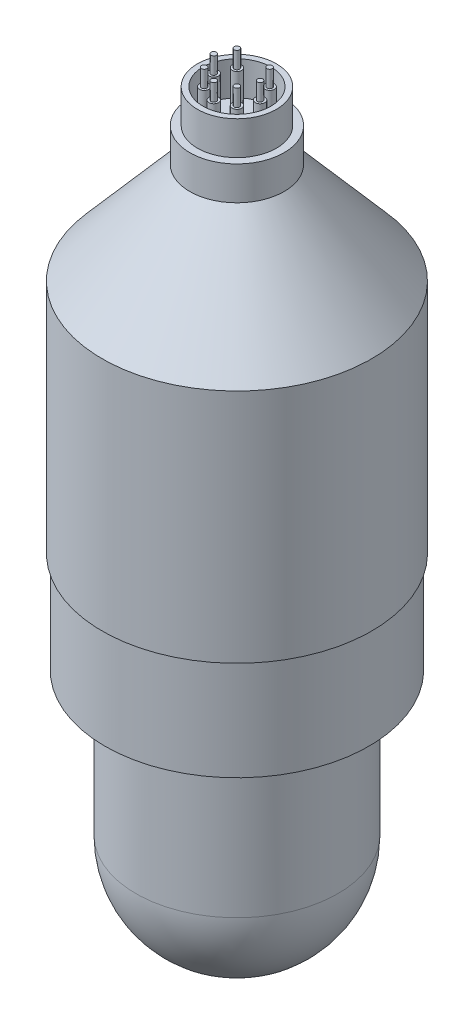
ISO-10303-21;
HEADER;
FILE_DESCRIPTION(('STEP AP214'),'2;1');
FILE_NAME('part.step','',(''),(''),'','','');
FILE_SCHEMA(('AUTOMOTIVE_DESIGN { 1 0 10303 214 1 1 1 1 }'));
ENDSEC;
DATA;
#1=APPLICATION_CONTEXT('core data for automotive mechanical design processes');
#2=APPLICATION_PROTOCOL_DEFINITION('international standard','automotive_design',2000,#1);
#3=PRODUCT_CONTEXT('',#1,'mechanical');
#4=PRODUCT('Part','Part','',(#3));
#5=PRODUCT_RELATED_PRODUCT_CATEGORY('part','',(#4));
#6=PRODUCT_DEFINITION_FORMATION('','',#4);
#7=PRODUCT_DEFINITION_CONTEXT('part definition',#1,'design');
#8=PRODUCT_DEFINITION('design','',#6,#7);
#9=PRODUCT_DEFINITION_SHAPE('','',#8);
#10=(LENGTH_UNIT() NAMED_UNIT(*) SI_UNIT(.MILLI.,.METRE.));
#11=(NAMED_UNIT(*) PLANE_ANGLE_UNIT() SI_UNIT($,.RADIAN.));
#12=(NAMED_UNIT(*) SI_UNIT($,.STERADIAN.) SOLID_ANGLE_UNIT());
#13=UNCERTAINTY_MEASURE_WITH_UNIT(LENGTH_MEASURE(1.E-05),#10,'distance_accuracy_value','');
#14=(GEOMETRIC_REPRESENTATION_CONTEXT(3) GLOBAL_UNCERTAINTY_ASSIGNED_CONTEXT((#13)) GLOBAL_UNIT_ASSIGNED_CONTEXT((#10,
#11,#12)) REPRESENTATION_CONTEXT('',''));
#15=CARTESIAN_POINT('',(0.,0.,0.));
#16=DIRECTION('',(0.,0.,1.));
#17=DIRECTION('',(1.,0.,0.));
#18=AXIS2_PLACEMENT_3D('',#15,#16,#17);
#19=CARTESIAN_POINT('',(0.,0.,0.));
#20=DIRECTION('',(0.,-1.,0.));
#21=DIRECTION('',(0.,0.,-1.));
#22=AXIS2_PLACEMENT_3D('',#19,#20,#21);
#23=CYLINDRICAL_SURFACE('',#22,50.8);
#24=CARTESIAN_POINT('',(0.,-19.304,0.));
#25=DIRECTION('',(0.,-1.,0.));
#26=DIRECTION('',(0.,0.,-1.));
#27=AXIS2_PLACEMENT_3D('',#24,#25,#26);
#28=CIRCLE('',#27,50.8);
#29=CARTESIAN_POINT('',(0.,-19.304,-50.8));
#30=VERTEX_POINT('',#29);
#31=EDGE_CURVE('E102',#30,#30,#28,.T.);
#32=ORIENTED_EDGE('',*,*,#31,.T.);
#33=EDGE_LOOP('',(#32));
#34=FACE_BOUND('',#33,.T.);
#35=CARTESIAN_POINT('',(0.,-108.204,0.));
#36=DIRECTION('',(0.,-1.,0.));
#37=DIRECTION('',(0.,0.,-1.));
#38=AXIS2_PLACEMENT_3D('',#35,#36,#37);
#39=CIRCLE('',#38,50.8);
#40=CARTESIAN_POINT('',(0.,-108.204,-50.8));
#41=VERTEX_POINT('',#40);
#42=EDGE_CURVE('E68',#41,#41,#39,.F.);
#43=ORIENTED_EDGE('',*,*,#42,.T.);
#44=EDGE_LOOP('',(#43));
#45=FACE_BOUND('',#44,.T.);
#46=ADVANCED_FACE('F52',(#34,#45),#23,.T.);
#47=CARTESIAN_POINT('',(14.8868084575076,44.196,0.));
#48=DIRECTION('',(0.,1.,0.));
#49=DIRECTION('',(0.,0.,1.));
#50=AXIS2_PLACEMENT_3D('',#47,#48,#49);
#51=PLANE('',#50);
#52=CARTESIAN_POINT('',(0.,44.196,0.));
#53=DIRECTION('',(0.,-1.,0.));
#54=DIRECTION('',(0.,0.,-1.));
#55=AXIS2_PLACEMENT_3D('',#52,#53,#54);
#56=CIRCLE('',#55,12.827);
#57=CARTESIAN_POINT('',(0.,44.196,-12.827));
#58=VERTEX_POINT('',#57);
#59=EDGE_CURVE('E11',#58,#58,#56,.T.);
#60=ORIENTED_EDGE('',*,*,#59,.T.);
#61=EDGE_LOOP('',(#60));
#62=FACE_BOUND('',#61,.T.);
#63=CARTESIAN_POINT('',(0.,44.196,0.));
#64=DIRECTION('',(0.,-1.,0.));
#65=DIRECTION('',(0.,0.,-1.));
#66=AXIS2_PLACEMENT_3D('',#63,#64,#65);
#67=CIRCLE('',#66,14.8868084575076);
#68=CARTESIAN_POINT('',(0.,44.196,-14.8868084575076));
#69=VERTEX_POINT('',#68);
#70=EDGE_CURVE('E90',#69,#69,#67,.T.);
#71=ORIENTED_EDGE('',*,*,#70,.F.);
#72=EDGE_LOOP('',(#71));
#73=FACE_BOUND('',#72,.T.);
#74=ADVANCED_FACE('F54',(#62,#73),#51,.T.);
#75=CARTESIAN_POINT('',(0.,0.,0.));
#76=DIRECTION('',(0.,-1.,0.));
#77=DIRECTION('',(0.,0.,-1.));
#78=AXIS2_PLACEMENT_3D('',#75,#76,#77);
#79=CYLINDRICAL_SURFACE('',#78,12.827);
#80=CARTESIAN_POINT('',(0.,11.557,0.));
#81=DIRECTION('',(0.,-1.,0.));
#82=DIRECTION('',(0.,0.,-1.));
#83=AXIS2_PLACEMENT_3D('',#80,#81,#82);
#84=CIRCLE('',#83,12.827);
#85=CARTESIAN_POINT('',(0.,11.557,-12.827));
#86=VERTEX_POINT('',#85);
#87=EDGE_CURVE('E60',#86,#86,#84,.T.);
#88=ORIENTED_EDGE('',*,*,#87,.T.);
#89=EDGE_LOOP('',(#88));
#90=FACE_BOUND('',#89,.T.);
#91=ORIENTED_EDGE('',*,*,#59,.F.);
#92=EDGE_LOOP('',(#91));
#93=FACE_BOUND('',#92,.T.);
#94=ADVANCED_FACE('F150',(#90,#93),#79,.F.);
#95=CARTESIAN_POINT('',(12.827,11.557,0.));
#96=DIRECTION('',(0.,1.,0.));
#97=DIRECTION('',(0.,0.,1.));
#98=AXIS2_PLACEMENT_3D('',#95,#96,#97);
#99=PLANE('',#98);
#100=CARTESIAN_POINT('',(0.,11.557,0.));
#101=DIRECTION('',(0.,-1.,0.));
#102=DIRECTION('',(0.,0.,-1.));
#103=AXIS2_PLACEMENT_3D('',#100,#101,#102);
#104=CIRCLE('',#103,9.43913447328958);
#105=CARTESIAN_POINT('',(0.,11.557,-9.43913447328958));
#106=VERTEX_POINT('',#105);
#107=EDGE_CURVE('E65',#106,#106,#104,.T.);
#108=ORIENTED_EDGE('',*,*,#107,.T.);
#109=EDGE_LOOP('',(#108));
#110=FACE_BOUND('',#109,.T.);
#111=ORIENTED_EDGE('',*,*,#87,.F.);
#112=EDGE_LOOP('',(#111));
#113=FACE_BOUND('',#112,.T.);
#114=ADVANCED_FACE('F135',(#110,#113),#99,.T.);
#115=CARTESIAN_POINT('',(0.,0.,0.));
#116=DIRECTION('',(0.,-1.,0.));
#117=DIRECTION('',(0.,0.,-1.));
#118=AXIS2_PLACEMENT_3D('',#115,#116,#117);
#119=CYLINDRICAL_SURFACE('',#118,9.43913447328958);
#120=CARTESIAN_POINT('',(0.,7.747,0.));
#121=DIRECTION('',(0.,-1.,0.));
#122=DIRECTION('',(0.,0.,-1.));
#123=AXIS2_PLACEMENT_3D('',#120,#121,#122);
#124=CIRCLE('',#123,9.43913447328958);
#125=CARTESIAN_POINT('',(0.,7.747,-9.43913447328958));
#126=VERTEX_POINT('',#125);
#127=EDGE_CURVE('E130',#126,#126,#124,.T.);
#128=ORIENTED_EDGE('',*,*,#127,.T.);
#129=EDGE_LOOP('',(#128));
#130=FACE_BOUND('',#129,.T.);
#131=ORIENTED_EDGE('',*,*,#107,.F.);
#132=EDGE_LOOP('',(#131));
#133=FACE_BOUND('',#132,.T.);
#134=ADVANCED_FACE('F138',(#130,#133),#119,.F.);
#135=CARTESIAN_POINT('',(9.43913447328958,7.747,0.));
#136=DIRECTION('',(0.,-1.,0.));
#137=DIRECTION('',(0.,0.,-1.));
#138=AXIS2_PLACEMENT_3D('',#135,#136,#137);
#139=PLANE('',#138);
#140=CARTESIAN_POINT('',(0.,7.747,0.));
#141=DIRECTION('',(0.,-1.,0.));
#142=DIRECTION('',(0.,0.,-1.));
#143=AXIS2_PLACEMENT_3D('',#140,#141,#142);
#144=CIRCLE('',#143,11.1255226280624);
#145=CARTESIAN_POINT('',(0.,7.747,-11.1255226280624));
#146=VERTEX_POINT('',#145);
#147=EDGE_CURVE('E127',#146,#146,#144,.T.);
#148=ORIENTED_EDGE('',*,*,#147,.T.);
#149=EDGE_LOOP('',(#148));
#150=FACE_BOUND('',#149,.T.);
#151=ORIENTED_EDGE('',*,*,#127,.F.);
#152=EDGE_LOOP('',(#151));
#153=FACE_BOUND('',#152,.T.);
#154=ADVANCED_FACE('F140',(#150,#153),#139,.T.);
#155=CARTESIAN_POINT('',(0.,0.,0.));
#156=DIRECTION('',(0.,-1.,0.));
#157=DIRECTION('',(0.,0.,-1.));
#158=AXIS2_PLACEMENT_3D('',#155,#156,#157);
#159=CYLINDRICAL_SURFACE('',#158,11.1255226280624);
#160=CARTESIAN_POINT('',(0.,-0.127,0.));
#161=DIRECTION('',(0.,-1.,0.));
#162=DIRECTION('',(0.,0.,-1.));
#163=AXIS2_PLACEMENT_3D('',#160,#161,#162);
#164=CIRCLE('',#163,11.1255226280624);
#165=CARTESIAN_POINT('',(0.,-0.127,-11.1255226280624));
#166=VERTEX_POINT('',#165);
#167=EDGE_CURVE('E124',#166,#166,#164,.T.);
#168=ORIENTED_EDGE('',*,*,#167,.T.);
#169=EDGE_LOOP('',(#168));
#170=FACE_BOUND('',#169,.T.);
#171=ORIENTED_EDGE('',*,*,#147,.F.);
#172=EDGE_LOOP('',(#171));
#173=FACE_BOUND('',#172,.T.);
#174=ADVANCED_FACE('F147',(#170,#173),#159,.F.);
#175=CARTESIAN_POINT('',(4.9276,-0.127,0.));
#176=DIRECTION('',(0.,1.,0.));
#177=DIRECTION('',(0.,0.,1.));
#178=AXIS2_PLACEMENT_3D('',#175,#176,#177);
#179=PLANE('',#178);
#180=CARTESIAN_POINT('',(0.,-0.127,0.));
#181=DIRECTION('',(0.,-1.,0.));
#182=DIRECTION('',(0.,0.,-1.));
#183=AXIS2_PLACEMENT_3D('',#180,#181,#182);
#184=CIRCLE('',#183,4.9276);
#185=CARTESIAN_POINT('',(0.,-0.127,-4.9276));
#186=VERTEX_POINT('',#185);
#187=EDGE_CURVE('E121',#186,#186,#184,.T.);
#188=ORIENTED_EDGE('',*,*,#187,.T.);
#189=EDGE_LOOP('',(#188));
#190=FACE_BOUND('',#189,.T.);
#191=ORIENTED_EDGE('',*,*,#167,.F.);
#192=EDGE_LOOP('',(#191));
#193=FACE_BOUND('',#192,.T.);
#194=ADVANCED_FACE('F190',(#190,#193),#179,.T.);
#195=CARTESIAN_POINT('',(0.,0.,0.));
#196=DIRECTION('',(0.,-1.,0.));
#197=DIRECTION('',(0.,0.,-1.));
#198=AXIS2_PLACEMENT_3D('',#195,#196,#197);
#199=CYLINDRICAL_SURFACE('',#198,4.9276);
#200=CARTESIAN_POINT('',(0.,-1.143,0.));
#201=DIRECTION('',(0.,-1.,0.));
#202=DIRECTION('',(0.,0.,-1.));
#203=AXIS2_PLACEMENT_3D('',#200,#201,#202);
#204=CIRCLE('',#203,4.9276);
#205=CARTESIAN_POINT('',(0.,-1.143,-4.9276));
#206=VERTEX_POINT('',#205);
#207=EDGE_CURVE('E118',#206,#206,#204,.T.);
#208=ORIENTED_EDGE('',*,*,#207,.T.);
#209=EDGE_LOOP('',(#208));
#210=FACE_BOUND('',#209,.T.);
#211=ORIENTED_EDGE('',*,*,#187,.F.);
#212=EDGE_LOOP('',(#211));
#213=FACE_BOUND('',#212,.T.);
#214=ADVANCED_FACE('F186',(#210,#213),#199,.F.);
#215=CARTESIAN_POINT('',(5.68325,-1.143,0.));
#216=DIRECTION('',(0.,-1.,0.));
#217=DIRECTION('',(0.,0.,-1.));
#218=AXIS2_PLACEMENT_3D('',#215,#216,#217);
#219=PLANE('',#218);
#220=CARTESIAN_POINT('',(0.,-1.143,0.));
#221=DIRECTION('',(0.,-1.,0.));
#222=DIRECTION('',(0.,0.,-1.));
#223=AXIS2_PLACEMENT_3D('',#220,#221,#222);
#224=CIRCLE('',#223,5.68325);
#225=CARTESIAN_POINT('',(0.,-1.143,-5.68325));
#226=VERTEX_POINT('',#225);
#227=EDGE_CURVE('E115',#226,#226,#224,.T.);
#228=ORIENTED_EDGE('',*,*,#227,.T.);
#229=EDGE_LOOP('',(#228));
#230=FACE_BOUND('',#229,.T.);
#231=ORIENTED_EDGE('',*,*,#207,.F.);
#232=EDGE_LOOP('',(#231));
#233=FACE_BOUND('',#232,.T.);
#234=ADVANCED_FACE('F182',(#230,#233),#219,.T.);
#235=CARTESIAN_POINT('',(0.,0.,0.));
#236=DIRECTION('',(0.,-1.,0.));
#237=DIRECTION('',(0.,0.,-1.));
#238=AXIS2_PLACEMENT_3D('',#235,#236,#237);
#239=CYLINDRICAL_SURFACE('',#238,5.68325);
#240=CARTESIAN_POINT('',(0.,-19.177,0.));
#241=DIRECTION('',(0.,-1.,0.));
#242=DIRECTION('',(0.,0.,-1.));
#243=AXIS2_PLACEMENT_3D('',#240,#241,#242);
#244=CIRCLE('',#243,5.68325);
#245=CARTESIAN_POINT('',(0.,-19.177,-5.68325));
#246=VERTEX_POINT('',#245);
#247=EDGE_CURVE('E112',#246,#246,#244,.T.);
#248=ORIENTED_EDGE('',*,*,#247,.T.);
#249=EDGE_LOOP('',(#248));
#250=FACE_BOUND('',#249,.T.);
#251=ORIENTED_EDGE('',*,*,#227,.F.);
#252=EDGE_LOOP('',(#251));
#253=FACE_BOUND('',#252,.T.);
#254=ADVANCED_FACE('F178',(#250,#253),#239,.F.);
#255=CARTESIAN_POINT('',(0.,-19.177,0.));
#256=DIRECTION('',(0.,1.,0.));
#257=DIRECTION('',(0.,0.,1.));
#258=AXIS2_PLACEMENT_3D('',#255,#256,#257);
#259=PLANE('',#258);
#260=ORIENTED_EDGE('',*,*,#247,.F.);
#261=EDGE_LOOP('',(#260));
#262=FACE_BOUND('',#261,.T.);
#263=ADVANCED_FACE('F175',(#262),#259,.T.);
#264=CARTESIAN_POINT('',(0.,-19.304,0.));
#265=DIRECTION('',(0.,-1.,0.));
#266=DIRECTION('',(0.,0.,-1.));
#267=AXIS2_PLACEMENT_3D('',#264,#265,#266);
#268=CONICAL_SURFACE('',#267,50.8,0.714090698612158);
#269=CARTESIAN_POINT('',(0.,18.796,0.));
#270=DIRECTION('',(0.,-1.,0.));
#271=DIRECTION('',(0.,0.,-1.));
#272=AXIS2_PLACEMENT_3D('',#269,#270,#271);
#273=CIRCLE('',#272,17.78);
#274=CARTESIAN_POINT('',(0.,18.796,-17.78));
#275=VERTEX_POINT('',#274);
#276=EDGE_CURVE('E99',#275,#275,#273,.T.);
#277=ORIENTED_EDGE('',*,*,#276,.T.);
#278=EDGE_LOOP('',(#277));
#279=FACE_BOUND('',#278,.T.);
#280=ORIENTED_EDGE('',*,*,#31,.F.);
#281=EDGE_LOOP('',(#280));
#282=FACE_BOUND('',#281,.T.);
#283=ADVANCED_FACE('F160',(#279,#282),#268,.T.);
#284=CARTESIAN_POINT('',(0.,0.,0.));
#285=DIRECTION('',(0.,-1.,0.));
#286=DIRECTION('',(0.,0.,-1.));
#287=AXIS2_PLACEMENT_3D('',#284,#285,#286);
#288=CYLINDRICAL_SURFACE('',#287,17.78);
#289=CARTESIAN_POINT('',(0.,31.496,0.));
#290=DIRECTION('',(0.,-1.,0.));
#291=DIRECTION('',(0.,0.,-1.));
#292=AXIS2_PLACEMENT_3D('',#289,#290,#291);
#293=CIRCLE('',#292,17.78);
#294=CARTESIAN_POINT('',(0.,31.496,-17.78));
#295=VERTEX_POINT('',#294);
#296=EDGE_CURVE('E96',#295,#295,#293,.T.);
#297=ORIENTED_EDGE('',*,*,#296,.T.);
#298=EDGE_LOOP('',(#297));
#299=FACE_BOUND('',#298,.T.);
#300=ORIENTED_EDGE('',*,*,#276,.F.);
#301=EDGE_LOOP('',(#300));
#302=FACE_BOUND('',#301,.T.);
#303=ADVANCED_FACE('F234',(#299,#302),#288,.T.);
#304=CARTESIAN_POINT('',(14.8868084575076,31.496,0.));
#305=DIRECTION('',(0.,1.,0.));
#306=DIRECTION('',(0.,0.,1.));
#307=AXIS2_PLACEMENT_3D('',#304,#305,#306);
#308=PLANE('',#307);
#309=CARTESIAN_POINT('',(0.,31.496,0.));
#310=DIRECTION('',(0.,-1.,0.));
#311=DIRECTION('',(0.,0.,-1.));
#312=AXIS2_PLACEMENT_3D('',#309,#310,#311);
#313=CIRCLE('',#312,14.8868084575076);
#314=CARTESIAN_POINT('',(0.,31.496,-14.8868084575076));
#315=VERTEX_POINT('',#314);
#316=EDGE_CURVE('E93',#315,#315,#313,.T.);
#317=ORIENTED_EDGE('',*,*,#316,.T.);
#318=EDGE_LOOP('',(#317));
#319=FACE_BOUND('',#318,.T.);
#320=ORIENTED_EDGE('',*,*,#296,.F.);
#321=EDGE_LOOP('',(#320));
#322=FACE_BOUND('',#321,.T.);
#323=ADVANCED_FACE('F242',(#319,#322),#308,.T.);
#324=CARTESIAN_POINT('',(0.,0.,0.));
#325=DIRECTION('',(0.,-1.,0.));
#326=DIRECTION('',(0.,0.,-1.));
#327=AXIS2_PLACEMENT_3D('',#324,#325,#326);
#328=CYLINDRICAL_SURFACE('',#327,14.8868084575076);
#329=ORIENTED_EDGE('',*,*,#70,.T.);
#330=EDGE_LOOP('',(#329));
#331=FACE_BOUND('',#330,.T.);
#332=ORIENTED_EDGE('',*,*,#316,.F.);
#333=EDGE_LOOP('',(#332));
#334=FACE_BOUND('',#333,.T.);
#335=ADVANCED_FACE('F249',(#331,#334),#328,.T.);
#336=CARTESIAN_POINT('',(0.,0.,0.));
#337=DIRECTION('',(0.,1.,0.));
#338=DIRECTION('',(0.,0.,1.));
#339=AXIS2_PLACEMENT_3D('',#336,#337,#338);
#340=CYLINDRICAL_SURFACE('',#339,49.784);
#341=CARTESIAN_POINT('',(0.,-146.304,0.));
#342=DIRECTION('',(0.,-1.,0.));
#343=DIRECTION('',(0.,0.,-1.));
#344=AXIS2_PLACEMENT_3D('',#341,#342,#343);
#345=CIRCLE('',#344,49.784);
#346=CARTESIAN_POINT('',(0.,-146.304,-49.784));
#347=VERTEX_POINT('',#346);
#348=EDGE_CURVE('E56',#347,#347,#345,.T.);
#349=ORIENTED_EDGE('',*,*,#348,.F.);
#350=EDGE_LOOP('',(#349));
#351=FACE_BOUND('',#350,.T.);
#352=CARTESIAN_POINT('',(0.,-108.204,0.));
#353=DIRECTION('',(0.,1.,0.));
#354=DIRECTION('',(0.,0.,1.));
#355=AXIS2_PLACEMENT_3D('',#352,#353,#354);
#356=CIRCLE('',#355,49.784);
#357=CARTESIAN_POINT('',(0.,-108.204,49.784));
#358=VERTEX_POINT('',#357);
#359=EDGE_CURVE('E71',#358,#358,#356,.T.);
#360=ORIENTED_EDGE('',*,*,#359,.F.);
#361=EDGE_LOOP('',(#360));
#362=FACE_BOUND('',#361,.T.);
#363=ADVANCED_FACE('F257',(#351,#362),#340,.T.);
#364=CARTESIAN_POINT('',(49.784,-108.204,0.));
#365=DIRECTION('',(0.,-1.,0.));
#366=DIRECTION('',(0.,0.,-1.));
#367=AXIS2_PLACEMENT_3D('',#364,#365,#366);
#368=PLANE('',#367);
#369=ORIENTED_EDGE('',*,*,#42,.F.);
#370=EDGE_LOOP('',(#369));
#371=FACE_BOUND('',#370,.T.);
#372=ORIENTED_EDGE('',*,*,#359,.T.);
#373=EDGE_LOOP('',(#372));
#374=FACE_BOUND('',#373,.T.);
#375=ADVANCED_FACE('F173',(#371,#374),#368,.T.);
#376=CARTESIAN_POINT('',(0.,-200.279,0.));
#377=DIRECTION('',(0.,-1.,0.));
#378=DIRECTION('',(-1.,0.,0.));
#379=AXIS2_PLACEMENT_3D('',#376,#377,#378);
#380=SPHERICAL_SURFACE('',#379,38.1);
#381=CARTESIAN_POINT('',(0.,-200.279,0.));
#382=DIRECTION('',(0.,-1.,0.));
#383=DIRECTION('',(0.,0.,-1.));
#384=AXIS2_PLACEMENT_3D('',#381,#382,#383);
#385=CIRCLE('',#384,38.1);
#386=CARTESIAN_POINT('',(0.,-200.279,-38.1));
#387=VERTEX_POINT('',#386);
#388=EDGE_CURVE('E109',#387,#387,#385,.T.);
#389=ORIENTED_EDGE('',*,*,#388,.T.);
#390=EDGE_LOOP('',(#389));
#391=FACE_BOUND('',#390,.T.);
#392=ADVANCED_FACE('F169',(#391),#380,.T.);
#393=CARTESIAN_POINT('',(0.,0.,0.));
#394=DIRECTION('',(0.,-1.,0.));
#395=DIRECTION('',(0.,0.,-1.));
#396=AXIS2_PLACEMENT_3D('',#393,#394,#395);
#397=CYLINDRICAL_SURFACE('',#396,38.1);
#398=CARTESIAN_POINT('',(0.,-146.304,0.));
#399=DIRECTION('',(0.,-1.,0.));
#400=DIRECTION('',(0.,0.,-1.));
#401=AXIS2_PLACEMENT_3D('',#398,#399,#400);
#402=CIRCLE('',#401,38.1);
#403=CARTESIAN_POINT('',(0.,-146.304,-38.1));
#404=VERTEX_POINT('',#403);
#405=EDGE_CURVE('E105',#404,#404,#402,.T.);
#406=ORIENTED_EDGE('',*,*,#405,.T.);
#407=EDGE_LOOP('',(#406));
#408=FACE_BOUND('',#407,.T.);
#409=ORIENTED_EDGE('',*,*,#388,.F.);
#410=EDGE_LOOP('',(#409));
#411=FACE_BOUND('',#410,.T.);
#412=ADVANCED_FACE('F165',(#408,#411),#397,.T.);
#413=CARTESIAN_POINT('',(50.8,-146.304,0.));
#414=DIRECTION('',(0.,-1.,0.));
#415=DIRECTION('',(0.,0.,-1.));
#416=AXIS2_PLACEMENT_3D('',#413,#414,#415);
#417=PLANE('',#416);
#418=ORIENTED_EDGE('',*,*,#405,.F.);
#419=EDGE_LOOP('',(#418));
#420=FACE_BOUND('',#419,.T.);
#421=ORIENTED_EDGE('',*,*,#348,.T.);
#422=EDGE_LOOP('',(#421));
#423=FACE_BOUND('',#422,.T.);
#424=ADVANCED_FACE('F162',(#420,#423),#417,.T.);
#425=CLOSED_SHELL('',(#46,#74,#94,#114,#134,#154,#174,#194,#214,#234,#254,#263,#283,#303,#323,
#335,#363,#375,#392,#412,#424));
#426=CARTESIAN_POINT('',(0.,-214.5665,0.));
#427=DIRECTION('',(0.,1.,0.));
#428=DIRECTION('',(0.,0.,1.));
#429=AXIS2_PLACEMENT_3D('',#426,#427,#428);
#430=PLANE('',#429);
#431=CARTESIAN_POINT('',(0.,-214.5665,0.));
#432=DIRECTION('',(0.,1.,0.));
#433=DIRECTION('',(0.,0.,1.));
#434=AXIS2_PLACEMENT_3D('',#431,#432,#433);
#435=CIRCLE('',#434,20.6375);
#436=CARTESIAN_POINT('',(0.,-214.5665,20.6375));
#437=VERTEX_POINT('',#436);
#438=EDGE_CURVE('E87',#437,#437,#435,.T.);
#439=ORIENTED_EDGE('',*,*,#438,.T.);
#440=EDGE_LOOP('',(#439));
#441=FACE_BOUND('',#440,.T.);
#442=ADVANCED_FACE('F284',(#441),#430,.T.);
#443=CARTESIAN_POINT('',(0.,0.,0.));
#444=DIRECTION('',(0.,1.,0.));
#445=DIRECTION('',(0.,0.,1.));
#446=AXIS2_PLACEMENT_3D('',#443,#444,#445);
#447=CYLINDRICAL_SURFACE('',#446,20.6375);
#448=CARTESIAN_POINT('',(0.,-187.579,0.));
#449=DIRECTION('',(0.,1.,0.));
#450=DIRECTION('',(0.,0.,1.));
#451=AXIS2_PLACEMENT_3D('',#448,#449,#450);
#452=CIRCLE('',#451,20.6375);
#453=CARTESIAN_POINT('',(0.,-187.579,20.6375));
#454=VERTEX_POINT('',#453);
#455=EDGE_CURVE('E78',#454,#454,#452,.T.);
#456=ORIENTED_EDGE('',*,*,#455,.T.);
#457=EDGE_LOOP('',(#456));
#458=FACE_BOUND('',#457,.T.);
#459=ORIENTED_EDGE('',*,*,#438,.F.);
#460=EDGE_LOOP('',(#459));
#461=FACE_BOUND('',#460,.T.);
#462=ADVANCED_FACE('F287',(#458,#461),#447,.F.);
#463=CARTESIAN_POINT('',(0.,-187.579,0.));
#464=DIRECTION('',(0.,-1.,0.));
#465=DIRECTION('',(0.,0.,-1.));
#466=AXIS2_PLACEMENT_3D('',#463,#464,#465);
#467=PLANE('',#466);
#468=ORIENTED_EDGE('',*,*,#455,.F.);
#469=EDGE_LOOP('',(#468));
#470=FACE_BOUND('',#469,.T.);
#471=ADVANCED_FACE('F296',(#470),#467,.T.);
#472=CLOSED_SHELL('',(#442,#462,#471));
#473=ORIENTED_CLOSED_SHELL('',*,#472,.T.);
#474=BREP_WITH_VOIDS('B2',#425,(#473));
#475=CARTESIAN_POINT('',(5.49926131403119,0.,9.52500000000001));
#476=DIRECTION('',(0.,-1.,0.));
#477=DIRECTION('',(0.,0.,-1.));
#478=AXIS2_PLACEMENT_3D('',#475,#476,#477);
#479=PLANE('',#478);
#480=CARTESIAN_POINT('',(0.,0.,0.));
#481=DIRECTION('',(0.,-1.,0.));
#482=DIRECTION('',(0.,0.,-1.));
#483=AXIS2_PLACEMENT_3D('',#480,#481,#482);
#484=CIRCLE('',#483,8.7757);
#485=CARTESIAN_POINT('',(0.,0.,-8.7757));
#486=VERTEX_POINT('',#485);
#487=EDGE_CURVE('E642',#486,#486,#484,.T.);
#488=ORIENTED_EDGE('',*,*,#487,.F.);
#489=EDGE_LOOP('',(#488));
#490=FACE_BOUND('',#489,.T.);
#491=DIRECTION('',(0.5,0.,-0.866025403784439));
#492=VECTOR('',#491,1.);
#493=CARTESIAN_POINT('',(5.49926131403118,0.,9.52500000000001));
#494=LINE('',#493,#492);
#495=CARTESIAN_POINT('',(5.49926131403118,0.,9.52500000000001));
#496=VERTEX_POINT('',#495);
#497=CARTESIAN_POINT('',(10.9985226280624,0.,0.));
#498=VERTEX_POINT('',#497);
#499=EDGE_CURVE('E500',#496,#498,#494,.T.);
#500=ORIENTED_EDGE('',*,*,#499,.F.);
#501=DIRECTION('',(1.,0.,0.));
#502=VECTOR('',#501,1.);
#503=CARTESIAN_POINT('',(-5.49926131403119,0.,9.52500000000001));
#504=LINE('',#503,#502);
#505=CARTESIAN_POINT('',(-5.49926131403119,0.,9.52500000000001));
#506=VERTEX_POINT('',#505);
#507=EDGE_CURVE('E459',#506,#496,#504,.T.);
#508=ORIENTED_EDGE('',*,*,#507,.F.);
#509=DIRECTION('',(0.5,0.,0.866025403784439));
#510=VECTOR('',#509,1.);
#511=CARTESIAN_POINT('',(-10.9985226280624,0.,0.));
#512=LINE('',#511,#510);
#513=CARTESIAN_POINT('',(-10.9985226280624,0.,0.));
#514=VERTEX_POINT('',#513);
#515=EDGE_CURVE('E453',#514,#506,#512,.T.);
#516=ORIENTED_EDGE('',*,*,#515,.F.);
#517=DIRECTION('',(-0.5,0.,0.866025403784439));
#518=VECTOR('',#517,1.);
#519=CARTESIAN_POINT('',(-5.49926131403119,0.,-9.52500000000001));
#520=LINE('',#519,#518);
#521=CARTESIAN_POINT('',(-5.49926131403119,0.,-9.52500000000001));
#522=VERTEX_POINT('',#521);
#523=EDGE_CURVE('E490',#522,#514,#520,.T.);
#524=ORIENTED_EDGE('',*,*,#523,.F.);
#525=DIRECTION('',(-1.,0.,0.));
#526=VECTOR('',#525,1.);
#527=CARTESIAN_POINT('',(5.49926131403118,0.,-9.52500000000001));
#528=LINE('',#527,#526);
#529=CARTESIAN_POINT('',(5.49926131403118,0.,-9.52500000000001));
#530=VERTEX_POINT('',#529);
#531=EDGE_CURVE('E506',#530,#522,#528,.T.);
#532=ORIENTED_EDGE('',*,*,#531,.F.);
#533=DIRECTION('',(-0.5,0.,-0.866025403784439));
#534=VECTOR('',#533,1.);
#535=CARTESIAN_POINT('',(10.9985226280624,0.,0.));
#536=LINE('',#535,#534);
#537=EDGE_CURVE('E503',#498,#530,#536,.T.);
#538=ORIENTED_EDGE('',*,*,#537,.F.);
#539=EDGE_LOOP('',(#500,#508,#516,#524,#532,#538));
#540=FACE_BOUND('',#539,.T.);
#541=ADVANCED_FACE('F413',(#490,#540),#479,.T.);
#542=CARTESIAN_POINT('',(6.1739260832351,44.196,-6.17392608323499));
#543=DIRECTION('',(0.,1.,0.));
#544=DIRECTION('',(0.707106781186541,0.,0.707106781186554));
#545=AXIS2_PLACEMENT_3D('',#542,#543,#544);
#546=PLANE('',#545);
#547=CARTESIAN_POINT('',(6.1739260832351,44.196,-6.17392608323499));
#548=DIRECTION('',(0.,1.,0.));
#549=DIRECTION('',(0.707106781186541,0.,0.707106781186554));
#550=AXIS2_PLACEMENT_3D('',#547,#548,#549);
#551=CIRCLE('',#550,1.7859375);
#552=CARTESIAN_POINT('',(7.43677460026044,44.196,-4.91107756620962));
#553=VERTEX_POINT('',#552);
#554=EDGE_CURVE('E577',#553,#553,#551,.T.);
#555=ORIENTED_EDGE('',*,*,#554,.T.);
#556=EDGE_LOOP('',(#555));
#557=FACE_BOUND('',#556,.T.);
#558=CARTESIAN_POINT('',(6.1739260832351,44.196,-6.17392608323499));
#559=DIRECTION('',(0.,1.,0.));
#560=DIRECTION('',(0.707106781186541,0.,0.707106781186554));
#561=AXIS2_PLACEMENT_3D('',#558,#559,#560);
#562=CIRCLE('',#561,1.01552297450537);
#563=CARTESIAN_POINT('',(6.89200926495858,44.196,-5.4558429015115));
#564=VERTEX_POINT('',#563);
#565=EDGE_CURVE('E616',#564,#564,#562,.T.);
#566=ORIENTED_EDGE('',*,*,#565,.F.);
#567=EDGE_LOOP('',(#566));
#568=FACE_BOUND('',#567,.T.);
#569=ADVANCED_FACE('F649',(#557,#568),#546,.T.);
#570=CARTESIAN_POINT('',(-6.173926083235,44.196,-6.17392608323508));
#571=DIRECTION('',(0.,1.,0.));
#572=DIRECTION('',(0.707106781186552,0.,-0.707106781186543));
#573=AXIS2_PLACEMENT_3D('',#570,#571,#572);
#574=PLANE('',#573);
#575=CARTESIAN_POINT('',(-6.173926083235,44.196,-6.17392608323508));
#576=DIRECTION('',(0.,1.,0.));
#577=DIRECTION('',(0.707106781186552,0.,-0.707106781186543));
#578=AXIS2_PLACEMENT_3D('',#575,#576,#577);
#579=CIRCLE('',#578,1.7859375);
#580=CARTESIAN_POINT('',(-4.91107756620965,44.196,-7.43677460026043));
#581=VERTEX_POINT('',#580);
#582=EDGE_CURVE('E571',#581,#581,#579,.T.);
#583=ORIENTED_EDGE('',*,*,#582,.T.);
#584=EDGE_LOOP('',(#583));
#585=FACE_BOUND('',#584,.T.);
#586=CARTESIAN_POINT('',(-6.173926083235,44.196,-6.17392608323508));
#587=DIRECTION('',(0.,1.,0.));
#588=DIRECTION('',(0.707106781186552,0.,-0.707106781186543));
#589=AXIS2_PLACEMENT_3D('',#586,#587,#588);
#590=CIRCLE('',#589,1.01552297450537);
#591=CARTESIAN_POINT('',(-5.45584290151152,44.196,-6.89200926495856));
#592=VERTEX_POINT('',#591);
#593=EDGE_CURVE('E610',#592,#592,#590,.T.);
#594=ORIENTED_EDGE('',*,*,#593,.F.);
#595=EDGE_LOOP('',(#594));
#596=FACE_BOUND('',#595,.T.);
#597=ADVANCED_FACE('F655',(#585,#596),#574,.T.);
#598=CARTESIAN_POINT('',(-8.73125,44.196,0.));
#599=DIRECTION('',(0.,1.,0.));
#600=DIRECTION('',(0.,0.,-1.));
#601=AXIS2_PLACEMENT_3D('',#598,#599,#600);
#602=PLANE('',#601);
#603=CARTESIAN_POINT('',(-8.73125,44.196,0.));
#604=DIRECTION('',(0.,1.,0.));
#605=DIRECTION('',(0.,0.,-1.));
#606=AXIS2_PLACEMENT_3D('',#603,#604,#605);
#607=CIRCLE('',#606,1.7859375);
#608=CARTESIAN_POINT('',(-8.73124999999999,44.196,-1.78593750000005));
#609=VERTEX_POINT('',#608);
#610=EDGE_CURVE('E565',#609,#609,#607,.T.);
#611=ORIENTED_EDGE('',*,*,#610,.T.);
#612=EDGE_LOOP('',(#611));
#613=FACE_BOUND('',#612,.T.);
#614=CARTESIAN_POINT('',(-8.73125,44.196,0.));
#615=DIRECTION('',(0.,1.,0.));
#616=DIRECTION('',(0.,0.,-1.));
#617=AXIS2_PLACEMENT_3D('',#614,#615,#616);
#618=CIRCLE('',#617,1.01552297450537);
#619=CARTESIAN_POINT('',(-8.73125,44.196,-1.01552297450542));
#620=VERTEX_POINT('',#619);
#621=EDGE_CURVE('E604',#620,#620,#618,.T.);
#622=ORIENTED_EDGE('',*,*,#621,.F.);
#623=EDGE_LOOP('',(#622));
#624=FACE_BOUND('',#623,.T.);
#625=ADVANCED_FACE('F757',(#613,#624),#602,.T.);
#626=CARTESIAN_POINT('',(-6.17392608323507,44.196,6.17392608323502));
#627=DIRECTION('',(0.,1.,0.));
#628=DIRECTION('',(-0.707106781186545,0.,-0.70710678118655));
#629=AXIS2_PLACEMENT_3D('',#626,#627,#628);
#630=PLANE('',#629);
#631=CARTESIAN_POINT('',(-6.17392608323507,44.196,6.17392608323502));
#632=DIRECTION('',(0.,1.,0.));
#633=DIRECTION('',(-0.707106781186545,0.,-0.70710678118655));
#634=AXIS2_PLACEMENT_3D('',#631,#632,#633);
#635=CIRCLE('',#634,1.7859375);
#636=CARTESIAN_POINT('',(-7.43677460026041,44.196,4.91107756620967));
#637=VERTEX_POINT('',#636);
#638=EDGE_CURVE('E559',#637,#637,#635,.T.);
#639=ORIENTED_EDGE('',*,*,#638,.T.);
#640=EDGE_LOOP('',(#639));
#641=FACE_BOUND('',#640,.T.);
#642=CARTESIAN_POINT('',(-6.17392608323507,44.196,6.17392608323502));
#643=DIRECTION('',(0.,1.,0.));
#644=DIRECTION('',(-0.707106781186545,0.,-0.70710678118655));
#645=AXIS2_PLACEMENT_3D('',#642,#643,#644);
#646=CIRCLE('',#645,1.01552297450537);
#647=CARTESIAN_POINT('',(-6.89200926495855,44.196,5.45584290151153));
#648=VERTEX_POINT('',#647);
#649=EDGE_CURVE('E598',#648,#648,#646,.T.);
#650=ORIENTED_EDGE('',*,*,#649,.F.);
#651=EDGE_LOOP('',(#650));
#652=FACE_BOUND('',#651,.T.);
#653=ADVANCED_FACE('F765',(#641,#652),#630,.T.);
#654=CARTESIAN_POINT('',(0.,44.196,8.73125));
#655=DIRECTION('',(0.,1.,0.));
#656=DIRECTION('',(-1.,0.,0.));
#657=AXIS2_PLACEMENT_3D('',#654,#655,#656);
#658=PLANE('',#657);
#659=CARTESIAN_POINT('',(0.,44.196,8.73125));
#660=DIRECTION('',(0.,1.,0.));
#661=DIRECTION('',(-1.,0.,0.));
#662=AXIS2_PLACEMENT_3D('',#659,#660,#661);
#663=CIRCLE('',#662,1.7859375);
#664=CARTESIAN_POINT('',(-1.78593750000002,44.196,8.73125));
#665=VERTEX_POINT('',#664);
#666=EDGE_CURVE('E553',#665,#665,#663,.T.);
#667=ORIENTED_EDGE('',*,*,#666,.T.);
#668=EDGE_LOOP('',(#667));
#669=FACE_BOUND('',#668,.T.);
#670=CARTESIAN_POINT('',(0.,44.196,8.73125));
#671=DIRECTION('',(0.,1.,0.));
#672=DIRECTION('',(-1.,0.,0.));
#673=AXIS2_PLACEMENT_3D('',#670,#671,#672);
#674=CIRCLE('',#673,1.01552297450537);
#675=CARTESIAN_POINT('',(-1.0155229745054,44.196,8.73125));
#676=VERTEX_POINT('',#675);
#677=EDGE_CURVE('E592',#676,#676,#674,.T.);
#678=ORIENTED_EDGE('',*,*,#677,.F.);
#679=EDGE_LOOP('',(#678));
#680=FACE_BOUND('',#679,.T.);
#681=ADVANCED_FACE('F773',(#669,#680),#658,.T.);
#682=CARTESIAN_POINT('',(6.17392608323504,44.196,6.17392608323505));
#683=DIRECTION('',(0.,1.,0.));
#684=DIRECTION('',(-0.707106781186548,0.,0.707106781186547));
#685=AXIS2_PLACEMENT_3D('',#682,#683,#684);
#686=PLANE('',#685);
#687=CARTESIAN_POINT('',(6.17392608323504,44.196,6.17392608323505));
#688=DIRECTION('',(0.,1.,0.));
#689=DIRECTION('',(-0.707106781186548,0.,0.707106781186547));
#690=AXIS2_PLACEMENT_3D('',#687,#688,#689);
#691=CIRCLE('',#690,1.7859375);
#692=CARTESIAN_POINT('',(4.91107756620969,44.196,7.4367746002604));
#693=VERTEX_POINT('',#692);
#694=EDGE_CURVE('E547',#693,#693,#691,.T.);
#695=ORIENTED_EDGE('',*,*,#694,.T.);
#696=EDGE_LOOP('',(#695));
#697=FACE_BOUND('',#696,.T.);
#698=CARTESIAN_POINT('',(6.17392608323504,44.196,6.17392608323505));
#699=DIRECTION('',(0.,1.,0.));
#700=DIRECTION('',(-0.707106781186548,0.,0.707106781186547));
#701=AXIS2_PLACEMENT_3D('',#698,#699,#700);
#702=CIRCLE('',#701,1.01552297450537);
#703=CARTESIAN_POINT('',(5.45584290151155,44.196,6.89200926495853));
#704=VERTEX_POINT('',#703);
#705=EDGE_CURVE('E586',#704,#704,#702,.T.);
#706=ORIENTED_EDGE('',*,*,#705,.F.);
#707=EDGE_LOOP('',(#706));
#708=FACE_BOUND('',#707,.T.);
#709=ADVANCED_FACE('F781',(#697,#708),#686,.T.);
#710=CARTESIAN_POINT('',(0.,31.496,0.));
#711=DIRECTION('',(0.,1.,0.));
#712=DIRECTION('',(0.,0.,1.));
#713=AXIS2_PLACEMENT_3D('',#710,#711,#712);
#714=PLANE('',#713);
#715=CARTESIAN_POINT('',(-6.173926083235,31.496,-6.17392608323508));
#716=DIRECTION('',(0.,1.,0.));
#717=DIRECTION('',(0.707106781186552,0.,-0.707106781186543));
#718=AXIS2_PLACEMENT_3D('',#715,#716,#717);
#719=CIRCLE('',#718,1.7859375);
#720=CARTESIAN_POINT('',(-4.91107756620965,31.496,-7.43677460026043));
#721=VERTEX_POINT('',#720);
#722=EDGE_CURVE('E574',#721,#721,#719,.T.);
#723=ORIENTED_EDGE('',*,*,#722,.F.);
#724=EDGE_LOOP('',(#723));
#725=FACE_BOUND('',#724,.T.);
#726=CARTESIAN_POINT('',(-6.17392608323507,31.496,6.17392608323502));
#727=DIRECTION('',(0.,1.,0.));
#728=DIRECTION('',(-0.707106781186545,0.,-0.70710678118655));
#729=AXIS2_PLACEMENT_3D('',#726,#727,#728);
#730=CIRCLE('',#729,1.7859375);
#731=CARTESIAN_POINT('',(-7.43677460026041,31.496,4.91107756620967));
#732=VERTEX_POINT('',#731);
#733=EDGE_CURVE('E562',#732,#732,#730,.T.);
#734=ORIENTED_EDGE('',*,*,#733,.F.);
#735=EDGE_LOOP('',(#734));
#736=FACE_BOUND('',#735,.T.);
#737=CARTESIAN_POINT('',(6.17392608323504,31.496,6.17392608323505));
#738=DIRECTION('',(0.,1.,0.));
#739=DIRECTION('',(-0.707106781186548,0.,0.707106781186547));
#740=AXIS2_PLACEMENT_3D('',#737,#738,#739);
#741=CIRCLE('',#740,1.7859375);
#742=CARTESIAN_POINT('',(4.91107756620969,31.496,7.4367746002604));
#743=VERTEX_POINT('',#742);
#744=EDGE_CURVE('E550',#743,#743,#741,.T.);
#745=ORIENTED_EDGE('',*,*,#744,.F.);
#746=EDGE_LOOP('',(#745));
#747=FACE_BOUND('',#746,.T.);
#748=CARTESIAN_POINT('',(0.,31.496,0.));
#749=DIRECTION('',(0.,1.,0.));
#750=DIRECTION('',(0.,0.,1.));
#751=AXIS2_PLACEMENT_3D('',#748,#749,#750);
#752=CIRCLE('',#751,12.7);
#753=CARTESIAN_POINT('',(0.,31.496,12.7));
#754=VERTEX_POINT('',#753);
#755=EDGE_CURVE('E531',#754,#754,#752,.T.);
#756=ORIENTED_EDGE('',*,*,#755,.T.);
#757=EDGE_LOOP('',(#756));
#758=FACE_BOUND('',#757,.T.);
#759=CARTESIAN_POINT('',(8.73125,31.496,0.));
#760=DIRECTION('',(0.,1.,0.));
#761=DIRECTION('',(0.,0.,1.));
#762=AXIS2_PLACEMENT_3D('',#759,#760,#761);
#763=CIRCLE('',#762,1.7859375);
#764=CARTESIAN_POINT('',(8.73125,31.496,1.7859375));
#765=VERTEX_POINT('',#764);
#766=EDGE_CURVE('E538',#765,#765,#763,.T.);
#767=ORIENTED_EDGE('',*,*,#766,.F.);
#768=EDGE_LOOP('',(#767));
#769=FACE_BOUND('',#768,.T.);
#770=CARTESIAN_POINT('',(0.,31.496,8.73125));
#771=DIRECTION('',(0.,1.,0.));
#772=DIRECTION('',(-1.,0.,0.));
#773=AXIS2_PLACEMENT_3D('',#770,#771,#772);
#774=CIRCLE('',#773,1.7859375);
#775=CARTESIAN_POINT('',(-1.78593750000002,31.496,8.73125));
#776=VERTEX_POINT('',#775);
#777=EDGE_CURVE('E556',#776,#776,#774,.T.);
#778=ORIENTED_EDGE('',*,*,#777,.F.);
#779=EDGE_LOOP('',(#778));
#780=FACE_BOUND('',#779,.T.);
#781=CARTESIAN_POINT('',(-8.73125,31.496,0.));
#782=DIRECTION('',(0.,1.,0.));
#783=DIRECTION('',(0.,0.,-1.));
#784=AXIS2_PLACEMENT_3D('',#781,#782,#783);
#785=CIRCLE('',#784,1.7859375);
#786=CARTESIAN_POINT('',(-8.73124999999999,31.496,-1.78593750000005));
#787=VERTEX_POINT('',#786);
#788=EDGE_CURVE('E568',#787,#787,#785,.T.);
#789=ORIENTED_EDGE('',*,*,#788,.F.);
#790=EDGE_LOOP('',(#789));
#791=FACE_BOUND('',#790,.T.);
#792=CARTESIAN_POINT('',(6.1739260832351,31.496,-6.17392608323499));
#793=DIRECTION('',(0.,1.,0.));
#794=DIRECTION('',(0.707106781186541,0.,0.707106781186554));
#795=AXIS2_PLACEMENT_3D('',#792,#793,#794);
#796=CIRCLE('',#795,1.7859375);
#797=CARTESIAN_POINT('',(7.43677460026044,31.496,-4.91107756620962));
#798=VERTEX_POINT('',#797);
#799=EDGE_CURVE('E580',#798,#798,#796,.T.);
#800=ORIENTED_EDGE('',*,*,#799,.F.);
#801=EDGE_LOOP('',(#800));
#802=FACE_BOUND('',#801,.T.);
#803=ADVANCED_FACE('F789',(#725,#736,#747,#758,#769,#780,#791,#802),#714,.T.);
#804=CARTESIAN_POINT('',(8.73125,44.196,0.));
#805=DIRECTION('',(0.,1.,0.));
#806=DIRECTION('',(0.,0.,1.));
#807=AXIS2_PLACEMENT_3D('',#804,#805,#806);
#808=PLANE('',#807);
#809=CARTESIAN_POINT('',(8.73125,44.196,0.));
#810=DIRECTION('',(0.,1.,0.));
#811=DIRECTION('',(0.,0.,1.));
#812=AXIS2_PLACEMENT_3D('',#809,#810,#811);
#813=CIRCLE('',#812,1.7859375);
#814=CARTESIAN_POINT('',(8.73125,44.196,1.7859375));
#815=VERTEX_POINT('',#814);
#816=EDGE_CURVE('E535',#815,#815,#813,.T.);
#817=ORIENTED_EDGE('',*,*,#816,.T.);
#818=EDGE_LOOP('',(#817));
#819=FACE_BOUND('',#818,.T.);
#820=CARTESIAN_POINT('',(8.73125,44.196,0.));
#821=DIRECTION('',(0.,1.,0.));
#822=DIRECTION('',(0.,0.,1.));
#823=AXIS2_PLACEMENT_3D('',#820,#821,#822);
#824=CIRCLE('',#823,1.01552297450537);
#825=CARTESIAN_POINT('',(8.73125,44.196,1.01552297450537));
#826=VERTEX_POINT('',#825);
#827=EDGE_CURVE('E544',#826,#826,#824,.T.);
#828=ORIENTED_EDGE('',*,*,#827,.F.);
#829=EDGE_LOOP('',(#828));
#830=FACE_BOUND('',#829,.T.);
#831=ADVANCED_FACE('F803',(#819,#830),#808,.T.);
#832=CARTESIAN_POINT('',(5.49926131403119,7.62,9.52500000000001));
#833=DIRECTION('',(0.,-1.,0.));
#834=DIRECTION('',(0.,0.,-1.));
#835=AXIS2_PLACEMENT_3D('',#832,#833,#834);
#836=PLANE('',#835);
#837=DIRECTION('',(0.5,0.,-0.866025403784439));
#838=VECTOR('',#837,1.);
#839=CARTESIAN_POINT('',(5.49926131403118,7.62,9.52500000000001));
#840=LINE('',#839,#838);
#841=CARTESIAN_POINT('',(5.49926131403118,7.62,9.52500000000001));
#842=VERTEX_POINT('',#841);
#843=CARTESIAN_POINT('',(10.9985226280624,7.62,0.));
#844=VERTEX_POINT('',#843);
#845=EDGE_CURVE('E511',#842,#844,#840,.T.);
#846=ORIENTED_EDGE('',*,*,#845,.T.);
#847=DIRECTION('',(-0.5,0.,-0.866025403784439));
#848=VECTOR('',#847,1.);
#849=CARTESIAN_POINT('',(10.9985226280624,7.62,0.));
#850=LINE('',#849,#848);
#851=CARTESIAN_POINT('',(5.49926131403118,7.62,-9.52500000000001));
#852=VERTEX_POINT('',#851);
#853=EDGE_CURVE('E468',#844,#852,#850,.T.);
#854=ORIENTED_EDGE('',*,*,#853,.T.);
#855=DIRECTION('',(-1.,0.,0.));
#856=VECTOR('',#855,1.);
#857=CARTESIAN_POINT('',(5.49926131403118,7.62,-9.52500000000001));
#858=LINE('',#857,#856);
#859=CARTESIAN_POINT('',(-5.49926131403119,7.62,-9.52500000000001));
#860=VERTEX_POINT('',#859);
#861=EDGE_CURVE('E482',#852,#860,#858,.T.);
#862=ORIENTED_EDGE('',*,*,#861,.T.);
#863=DIRECTION('',(-0.5,0.,0.866025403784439));
#864=VECTOR('',#863,1.);
#865=CARTESIAN_POINT('',(-5.49926131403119,7.62,-9.52500000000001));
#866=LINE('',#865,#864);
#867=CARTESIAN_POINT('',(-10.9985226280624,7.62,0.));
#868=VERTEX_POINT('',#867);
#869=EDGE_CURVE('E475',#860,#868,#866,.T.);
#870=ORIENTED_EDGE('',*,*,#869,.T.);
#871=DIRECTION('',(0.5,0.,0.866025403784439));
#872=VECTOR('',#871,1.);
#873=CARTESIAN_POINT('',(-10.9985226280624,7.62,0.));
#874=LINE('',#873,#872);
#875=CARTESIAN_POINT('',(-5.49926131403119,7.62,9.52500000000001));
#876=VERTEX_POINT('',#875);
#877=EDGE_CURVE('E480',#868,#876,#874,.T.);
#878=ORIENTED_EDGE('',*,*,#877,.T.);
#879=DIRECTION('',(1.,0.,0.));
#880=VECTOR('',#879,1.);
#881=CARTESIAN_POINT('',(-5.49926131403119,7.62,9.52500000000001));
#882=LINE('',#881,#880);
#883=EDGE_CURVE('E430',#876,#842,#882,.T.);
#884=ORIENTED_EDGE('',*,*,#883,.T.);
#885=EDGE_LOOP('',(#846,#854,#862,#870,#878,#884));
#886=FACE_BOUND('',#885,.T.);
#887=CARTESIAN_POINT('',(0.,7.62,0.));
#888=DIRECTION('',(0.,-1.,0.));
#889=DIRECTION('',(0.,0.,-1.));
#890=AXIS2_PLACEMENT_3D('',#887,#888,#889);
#891=CIRCLE('',#890,9.31213447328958);
#892=CARTESIAN_POINT('',(0.,7.62,-9.31213447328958));
#893=VERTEX_POINT('',#892);
#894=EDGE_CURVE('E49',#893,#893,#891,.F.);
#895=ORIENTED_EDGE('',*,*,#894,.F.);
#896=EDGE_LOOP('',(#895));
#897=FACE_BOUND('',#896,.T.);
#898=ADVANCED_FACE('F477',(#886,#897),#836,.F.);
#899=CARTESIAN_POINT('',(5.49926131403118,7.62,9.52500000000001));
#900=DIRECTION('',(-0.866025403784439,0.,-0.5));
#901=DIRECTION('',(-0.5,0.,0.866025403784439));
#902=AXIS2_PLACEMENT_3D('',#899,#900,#901);
#903=PLANE('',#902);
#904=ORIENTED_EDGE('',*,*,#499,.T.);
#905=DIRECTION('',(0.,-1.,0.));
#906=VECTOR('',#905,1.);
#907=CARTESIAN_POINT('',(10.9985226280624,7.62,0.));
#908=LINE('',#907,#906);
#909=EDGE_CURVE('E422',#844,#498,#908,.T.);
#910=ORIENTED_EDGE('',*,*,#909,.F.);
#911=ORIENTED_EDGE('',*,*,#845,.F.);
#912=DIRECTION('',(0.,-1.,0.));
#913=VECTOR('',#912,1.);
#914=CARTESIAN_POINT('',(5.49926131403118,7.62,9.52500000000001));
#915=LINE('',#914,#913);
#916=EDGE_CURVE('E496',#842,#496,#915,.T.);
#917=ORIENTED_EDGE('',*,*,#916,.T.);
#918=EDGE_LOOP('',(#904,#910,#911,#917));
#919=FACE_BOUND('',#918,.T.);
#920=ADVANCED_FACE('F415',(#919),#903,.F.);
#921=CARTESIAN_POINT('',(10.9985226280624,7.62,0.));
#922=DIRECTION('',(-0.866025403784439,0.,0.5));
#923=DIRECTION('',(0.5,0.,0.866025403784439));
#924=AXIS2_PLACEMENT_3D('',#921,#922,#923);
#925=PLANE('',#924);
#926=ORIENTED_EDGE('',*,*,#537,.T.);
#927=DIRECTION('',(0.,-1.,0.));
#928=VECTOR('',#927,1.);
#929=CARTESIAN_POINT('',(5.49926131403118,7.62,-9.52500000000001));
#930=LINE('',#929,#928);
#931=EDGE_CURVE('E515',#852,#530,#930,.T.);
#932=ORIENTED_EDGE('',*,*,#931,.F.);
#933=ORIENTED_EDGE('',*,*,#853,.F.);
#934=ORIENTED_EDGE('',*,*,#909,.T.);
#935=EDGE_LOOP('',(#926,#932,#933,#934));
#936=FACE_BOUND('',#935,.T.);
#937=ADVANCED_FACE('F518',(#936),#925,.F.);
#938=CARTESIAN_POINT('',(5.49926131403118,7.62,-9.52500000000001));
#939=DIRECTION('',(0.,0.,1.));
#940=DIRECTION('',(1.,0.,0.));
#941=AXIS2_PLACEMENT_3D('',#938,#939,#940);
#942=PLANE('',#941);
#943=ORIENTED_EDGE('',*,*,#531,.T.);
#944=DIRECTION('',(0.,-1.,0.));
#945=VECTOR('',#944,1.);
#946=CARTESIAN_POINT('',(-5.49926131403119,7.62,-9.52500000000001));
#947=LINE('',#946,#945);
#948=EDGE_CURVE('E491',#860,#522,#947,.T.);
#949=ORIENTED_EDGE('',*,*,#948,.F.);
#950=ORIENTED_EDGE('',*,*,#861,.F.);
#951=ORIENTED_EDGE('',*,*,#931,.T.);
#952=EDGE_LOOP('',(#943,#949,#950,#951));
#953=FACE_BOUND('',#952,.T.);
#954=ADVANCED_FACE('F525',(#953),#942,.F.);
#955=CARTESIAN_POINT('',(-5.49926131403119,7.62,-9.52500000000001));
#956=DIRECTION('',(0.866025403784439,0.,0.5));
#957=DIRECTION('',(0.5,0.,-0.866025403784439));
#958=AXIS2_PLACEMENT_3D('',#955,#956,#957);
#959=PLANE('',#958);
#960=ORIENTED_EDGE('',*,*,#523,.T.);
#961=DIRECTION('',(0.,-1.,0.));
#962=VECTOR('',#961,1.);
#963=CARTESIAN_POINT('',(-10.9985226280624,7.62,0.));
#964=LINE('',#963,#962);
#965=EDGE_CURVE('E487',#868,#514,#964,.T.);
#966=ORIENTED_EDGE('',*,*,#965,.F.);
#967=ORIENTED_EDGE('',*,*,#869,.F.);
#968=ORIENTED_EDGE('',*,*,#948,.T.);
#969=EDGE_LOOP('',(#960,#966,#967,#968));
#970=FACE_BOUND('',#969,.T.);
#971=ADVANCED_FACE('F488',(#970),#959,.F.);
#972=CARTESIAN_POINT('',(-10.9985226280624,7.62,0.));
#973=DIRECTION('',(0.866025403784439,0.,-0.5));
#974=DIRECTION('',(-0.5,0.,-0.866025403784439));
#975=AXIS2_PLACEMENT_3D('',#972,#973,#974);
#976=PLANE('',#975);
#977=ORIENTED_EDGE('',*,*,#515,.T.);
#978=DIRECTION('',(0.,-1.,0.));
#979=VECTOR('',#978,1.);
#980=CARTESIAN_POINT('',(-5.49926131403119,7.62,9.52500000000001));
#981=LINE('',#980,#979);
#982=EDGE_CURVE('E492',#876,#506,#981,.T.);
#983=ORIENTED_EDGE('',*,*,#982,.F.);
#984=ORIENTED_EDGE('',*,*,#877,.F.);
#985=ORIENTED_EDGE('',*,*,#965,.T.);
#986=EDGE_LOOP('',(#977,#983,#984,#985));
#987=FACE_BOUND('',#986,.T.);
#988=ADVANCED_FACE('F494',(#987),#976,.F.);
#989=CARTESIAN_POINT('',(-5.49926131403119,7.62,9.52500000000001));
#990=DIRECTION('',(0.,0.,-1.));
#991=DIRECTION('',(-1.,0.,0.));
#992=AXIS2_PLACEMENT_3D('',#989,#990,#991);
#993=PLANE('',#992);
#994=ORIENTED_EDGE('',*,*,#507,.T.);
#995=ORIENTED_EDGE('',*,*,#916,.F.);
#996=ORIENTED_EDGE('',*,*,#883,.F.);
#997=ORIENTED_EDGE('',*,*,#982,.T.);
#998=EDGE_LOOP('',(#994,#995,#996,#997));
#999=FACE_BOUND('',#998,.T.);
#1000=ADVANCED_FACE('F823',(#999),#993,.F.);
#1001=CARTESIAN_POINT('',(0.,11.684,0.));
#1002=DIRECTION('',(0.,-1.,0.));
#1003=DIRECTION('',(0.,0.,-1.));
#1004=AXIS2_PLACEMENT_3D('',#1001,#1002,#1003);
#1005=CYLINDRICAL_SURFACE('',#1004,9.31213447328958);
#1006=CARTESIAN_POINT('',(0.,11.684,0.));
#1007=DIRECTION('',(0.,1.,0.));
#1008=DIRECTION('',(0.,0.,1.));
#1009=AXIS2_PLACEMENT_3D('',#1006,#1007,#1008);
#1010=CIRCLE('',#1009,9.31213447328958);
#1011=CARTESIAN_POINT('',(0.,11.684,9.31213447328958));
#1012=VERTEX_POINT('',#1011);
#1013=EDGE_CURVE('E504',#1012,#1012,#1010,.T.);
#1014=ORIENTED_EDGE('',*,*,#1013,.F.);
#1015=EDGE_LOOP('',(#1014));
#1016=FACE_BOUND('',#1015,.T.);
#1017=ORIENTED_EDGE('',*,*,#894,.T.);
#1018=EDGE_LOOP('',(#1017));
#1019=FACE_BOUND('',#1018,.T.);
#1020=ADVANCED_FACE('F817',(#1016,#1019),#1005,.T.);
#1021=CARTESIAN_POINT('',(0.,11.684,0.));
#1022=DIRECTION('',(0.,1.,0.));
#1023=DIRECTION('',(0.,0.,1.));
#1024=AXIS2_PLACEMENT_3D('',#1021,#1022,#1023);
#1025=PLANE('',#1024);
#1026=CARTESIAN_POINT('',(0.,11.684,0.));
#1027=DIRECTION('',(0.,1.,0.));
#1028=DIRECTION('',(0.,0.,1.));
#1029=AXIS2_PLACEMENT_3D('',#1026,#1027,#1028);
#1030=CIRCLE('',#1029,12.7);
#1031=CARTESIAN_POINT('',(0.,11.684,12.7));
#1032=VERTEX_POINT('',#1031);
#1033=EDGE_CURVE('E532',#1032,#1032,#1030,.T.);
#1034=ORIENTED_EDGE('',*,*,#1033,.F.);
#1035=EDGE_LOOP('',(#1034));
#1036=FACE_BOUND('',#1035,.T.);
#1037=ORIENTED_EDGE('',*,*,#1013,.T.);
#1038=EDGE_LOOP('',(#1037));
#1039=FACE_BOUND('',#1038,.T.);
#1040=ADVANCED_FACE('F814',(#1036,#1039),#1025,.F.);
#1041=CARTESIAN_POINT('',(0.,31.496,0.));
#1042=DIRECTION('',(0.,-1.,0.));
#1043=DIRECTION('',(0.,0.,-1.));
#1044=AXIS2_PLACEMENT_3D('',#1041,#1042,#1043);
#1045=CYLINDRICAL_SURFACE('',#1044,12.7);
#1046=ORIENTED_EDGE('',*,*,#755,.F.);
#1047=EDGE_LOOP('',(#1046));
#1048=FACE_BOUND('',#1047,.T.);
#1049=ORIENTED_EDGE('',*,*,#1033,.T.);
#1050=EDGE_LOOP('',(#1049));
#1051=FACE_BOUND('',#1050,.T.);
#1052=ADVANCED_FACE('F809',(#1048,#1051),#1045,.T.);
#1053=CARTESIAN_POINT('',(8.73125,44.196,0.));
#1054=DIRECTION('',(0.,-1.,0.));
#1055=DIRECTION('',(0.,0.,-1.));
#1056=AXIS2_PLACEMENT_3D('',#1053,#1054,#1055);
#1057=CYLINDRICAL_SURFACE('',#1056,1.7859375);
#1058=ORIENTED_EDGE('',*,*,#816,.F.);
#1059=EDGE_LOOP('',(#1058));
#1060=FACE_BOUND('',#1059,.T.);
#1061=ORIENTED_EDGE('',*,*,#766,.T.);
#1062=EDGE_LOOP('',(#1061));
#1063=FACE_BOUND('',#1062,.T.);
#1064=ADVANCED_FACE('F801',(#1060,#1063),#1057,.T.);
#1065=CARTESIAN_POINT('',(8.73125,50.546,0.));
#1066=DIRECTION('',(0.,-1.,0.));
#1067=DIRECTION('',(0.,0.,-1.));
#1068=AXIS2_PLACEMENT_3D('',#1065,#1066,#1067);
#1069=CYLINDRICAL_SURFACE('',#1068,1.01552297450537);
#1070=CARTESIAN_POINT('',(8.73125,50.546,0.));
#1071=DIRECTION('',(0.,1.,0.));
#1072=DIRECTION('',(0.,0.,1.));
#1073=AXIS2_PLACEMENT_3D('',#1070,#1071,#1072);
#1074=CIRCLE('',#1073,1.01552297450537);
#1075=CARTESIAN_POINT('',(8.73125,50.546,1.01552297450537));
#1076=VERTEX_POINT('',#1075);
#1077=EDGE_CURVE('E541',#1076,#1076,#1074,.T.);
#1078=ORIENTED_EDGE('',*,*,#1077,.F.);
#1079=EDGE_LOOP('',(#1078));
#1080=FACE_BOUND('',#1079,.T.);
#1081=ORIENTED_EDGE('',*,*,#827,.T.);
#1082=EDGE_LOOP('',(#1081));
#1083=FACE_BOUND('',#1082,.T.);
#1084=ADVANCED_FACE('F797',(#1080,#1083),#1069,.T.);
#1085=CARTESIAN_POINT('',(8.73125,50.546,0.));
#1086=DIRECTION('',(0.,1.,0.));
#1087=DIRECTION('',(0.,0.,1.));
#1088=AXIS2_PLACEMENT_3D('',#1085,#1086,#1087);
#1089=PLANE('',#1088);
#1090=ORIENTED_EDGE('',*,*,#1077,.T.);
#1091=EDGE_LOOP('',(#1090));
#1092=FACE_BOUND('',#1091,.T.);
#1093=ADVANCED_FACE('F793',(#1092),#1089,.T.);
#1094=CARTESIAN_POINT('',(6.17392608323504,44.196,6.17392608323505));
#1095=DIRECTION('',(0.,-1.,0.));
#1096=DIRECTION('',(0.,0.,-1.));
#1097=AXIS2_PLACEMENT_3D('',#1094,#1095,#1096);
#1098=CYLINDRICAL_SURFACE('',#1097,1.7859375);
#1099=ORIENTED_EDGE('',*,*,#694,.F.);
#1100=EDGE_LOOP('',(#1099));
#1101=FACE_BOUND('',#1100,.T.);
#1102=ORIENTED_EDGE('',*,*,#744,.T.);
#1103=EDGE_LOOP('',(#1102));
#1104=FACE_BOUND('',#1103,.T.);
#1105=ADVANCED_FACE('F785',(#1101,#1104),#1098,.T.);
#1106=CARTESIAN_POINT('',(0.,44.196,8.73125));
#1107=DIRECTION('',(0.,-1.,0.));
#1108=DIRECTION('',(0.,0.,-1.));
#1109=AXIS2_PLACEMENT_3D('',#1106,#1107,#1108);
#1110=CYLINDRICAL_SURFACE('',#1109,1.7859375);
#1111=ORIENTED_EDGE('',*,*,#666,.F.);
#1112=EDGE_LOOP('',(#1111));
#1113=FACE_BOUND('',#1112,.T.);
#1114=ORIENTED_EDGE('',*,*,#777,.T.);
#1115=EDGE_LOOP('',(#1114));
#1116=FACE_BOUND('',#1115,.T.);
#1117=ADVANCED_FACE('F777',(#1113,#1116),#1110,.T.);
#1118=CARTESIAN_POINT('',(-6.17392608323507,44.196,6.17392608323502));
#1119=DIRECTION('',(0.,-1.,0.));
#1120=DIRECTION('',(0.,0.,-1.));
#1121=AXIS2_PLACEMENT_3D('',#1118,#1119,#1120);
#1122=CYLINDRICAL_SURFACE('',#1121,1.7859375);
#1123=ORIENTED_EDGE('',*,*,#638,.F.);
#1124=EDGE_LOOP('',(#1123));
#1125=FACE_BOUND('',#1124,.T.);
#1126=ORIENTED_EDGE('',*,*,#733,.T.);
#1127=EDGE_LOOP('',(#1126));
#1128=FACE_BOUND('',#1127,.T.);
#1129=ADVANCED_FACE('F769',(#1125,#1128),#1122,.T.);
#1130=CARTESIAN_POINT('',(-8.73125,44.196,0.));
#1131=DIRECTION('',(0.,-1.,0.));
#1132=DIRECTION('',(0.,0.,-1.));
#1133=AXIS2_PLACEMENT_3D('',#1130,#1131,#1132);
#1134=CYLINDRICAL_SURFACE('',#1133,1.7859375);
#1135=ORIENTED_EDGE('',*,*,#610,.F.);
#1136=EDGE_LOOP('',(#1135));
#1137=FACE_BOUND('',#1136,.T.);
#1138=ORIENTED_EDGE('',*,*,#788,.T.);
#1139=EDGE_LOOP('',(#1138));
#1140=FACE_BOUND('',#1139,.T.);
#1141=ADVANCED_FACE('F761',(#1137,#1140),#1134,.T.);
#1142=CARTESIAN_POINT('',(-6.173926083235,44.196,-6.17392608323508));
#1143=DIRECTION('',(0.,-1.,0.));
#1144=DIRECTION('',(0.,0.,-1.));
#1145=AXIS2_PLACEMENT_3D('',#1142,#1143,#1144);
#1146=CYLINDRICAL_SURFACE('',#1145,1.7859375);
#1147=ORIENTED_EDGE('',*,*,#582,.F.);
#1148=EDGE_LOOP('',(#1147));
#1149=FACE_BOUND('',#1148,.T.);
#1150=ORIENTED_EDGE('',*,*,#722,.T.);
#1151=EDGE_LOOP('',(#1150));
#1152=FACE_BOUND('',#1151,.T.);
#1153=ADVANCED_FACE('F753',(#1149,#1152),#1146,.T.);
#1154=CARTESIAN_POINT('',(6.1739260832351,44.196,-6.17392608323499));
#1155=DIRECTION('',(0.,-1.,0.));
#1156=DIRECTION('',(0.,0.,-1.));
#1157=AXIS2_PLACEMENT_3D('',#1154,#1155,#1156);
#1158=CYLINDRICAL_SURFACE('',#1157,1.7859375);
#1159=ORIENTED_EDGE('',*,*,#554,.F.);
#1160=EDGE_LOOP('',(#1159));
#1161=FACE_BOUND('',#1160,.T.);
#1162=ORIENTED_EDGE('',*,*,#799,.T.);
#1163=EDGE_LOOP('',(#1162));
#1164=FACE_BOUND('',#1163,.T.);
#1165=ADVANCED_FACE('F748',(#1161,#1164),#1158,.T.);
#1166=CARTESIAN_POINT('',(6.17392608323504,50.546,6.17392608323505));
#1167=DIRECTION('',(0.,-1.,0.));
#1168=DIRECTION('',(0.,0.,-1.));
#1169=AXIS2_PLACEMENT_3D('',#1166,#1167,#1168);
#1170=CYLINDRICAL_SURFACE('',#1169,1.01552297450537);
#1171=CARTESIAN_POINT('',(6.17392608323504,50.546,6.17392608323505));
#1172=DIRECTION('',(0.,1.,0.));
#1173=DIRECTION('',(-0.707106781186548,0.,0.707106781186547));
#1174=AXIS2_PLACEMENT_3D('',#1171,#1172,#1173);
#1175=CIRCLE('',#1174,1.01552297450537);
#1176=CARTESIAN_POINT('',(5.45584290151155,50.546,6.89200926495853));
#1177=VERTEX_POINT('',#1176);
#1178=EDGE_CURVE('E583',#1177,#1177,#1175,.T.);
#1179=ORIENTED_EDGE('',*,*,#1178,.F.);
#1180=EDGE_LOOP('',(#1179));
#1181=FACE_BOUND('',#1180,.T.);
#1182=ORIENTED_EDGE('',*,*,#705,.T.);
#1183=EDGE_LOOP('',(#1182));
#1184=FACE_BOUND('',#1183,.T.);
#1185=ADVANCED_FACE('F745',(#1181,#1184),#1170,.T.);
#1186=CARTESIAN_POINT('',(6.17392608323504,50.546,6.17392608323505));
#1187=DIRECTION('',(0.,1.,0.));
#1188=DIRECTION('',(-0.707106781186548,0.,0.707106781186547));
#1189=AXIS2_PLACEMENT_3D('',#1186,#1187,#1188);
#1190=PLANE('',#1189);
#1191=ORIENTED_EDGE('',*,*,#1178,.T.);
#1192=EDGE_LOOP('',(#1191));
#1193=FACE_BOUND('',#1192,.T.);
#1194=ADVANCED_FACE('F741',(#1193),#1190,.T.);
#1195=CARTESIAN_POINT('',(0.,50.546,8.73125));
#1196=DIRECTION('',(0.,-1.,0.));
#1197=DIRECTION('',(0.,0.,-1.));
#1198=AXIS2_PLACEMENT_3D('',#1195,#1196,#1197);
#1199=CYLINDRICAL_SURFACE('',#1198,1.01552297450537);
#1200=CARTESIAN_POINT('',(0.,50.546,8.73125));
#1201=DIRECTION('',(0.,1.,0.));
#1202=DIRECTION('',(-1.,0.,0.));
#1203=AXIS2_PLACEMENT_3D('',#1200,#1201,#1202);
#1204=CIRCLE('',#1203,1.01552297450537);
#1205=CARTESIAN_POINT('',(-1.0155229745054,50.546,8.73125));
#1206=VERTEX_POINT('',#1205);
#1207=EDGE_CURVE('E589',#1206,#1206,#1204,.T.);
#1208=ORIENTED_EDGE('',*,*,#1207,.F.);
#1209=EDGE_LOOP('',(#1208));
#1210=FACE_BOUND('',#1209,.T.);
#1211=ORIENTED_EDGE('',*,*,#677,.T.);
#1212=EDGE_LOOP('',(#1211));
#1213=FACE_BOUND('',#1212,.T.);
#1214=ADVANCED_FACE('F737',(#1210,#1213),#1199,.T.);
#1215=CARTESIAN_POINT('',(0.,50.546,8.73125));
#1216=DIRECTION('',(0.,1.,0.));
#1217=DIRECTION('',(-1.,0.,0.));
#1218=AXIS2_PLACEMENT_3D('',#1215,#1216,#1217);
#1219=PLANE('',#1218);
#1220=ORIENTED_EDGE('',*,*,#1207,.T.);
#1221=EDGE_LOOP('',(#1220));
#1222=FACE_BOUND('',#1221,.T.);
#1223=ADVANCED_FACE('F733',(#1222),#1219,.T.);
#1224=CARTESIAN_POINT('',(-6.17392608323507,50.546,6.17392608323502));
#1225=DIRECTION('',(0.,-1.,0.));
#1226=DIRECTION('',(0.,0.,-1.));
#1227=AXIS2_PLACEMENT_3D('',#1224,#1225,#1226);
#1228=CYLINDRICAL_SURFACE('',#1227,1.01552297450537);
#1229=CARTESIAN_POINT('',(-6.17392608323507,50.546,6.17392608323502));
#1230=DIRECTION('',(0.,1.,0.));
#1231=DIRECTION('',(-0.707106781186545,0.,-0.70710678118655));
#1232=AXIS2_PLACEMENT_3D('',#1229,#1230,#1231);
#1233=CIRCLE('',#1232,1.01552297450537);
#1234=CARTESIAN_POINT('',(-6.89200926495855,50.546,5.45584290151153));
#1235=VERTEX_POINT('',#1234);
#1236=EDGE_CURVE('E595',#1235,#1235,#1233,.T.);
#1237=ORIENTED_EDGE('',*,*,#1236,.F.);
#1238=EDGE_LOOP('',(#1237));
#1239=FACE_BOUND('',#1238,.T.);
#1240=ORIENTED_EDGE('',*,*,#649,.T.);
#1241=EDGE_LOOP('',(#1240));
#1242=FACE_BOUND('',#1241,.T.);
#1243=ADVANCED_FACE('F729',(#1239,#1242),#1228,.T.);
#1244=CARTESIAN_POINT('',(-6.17392608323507,50.546,6.17392608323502));
#1245=DIRECTION('',(0.,1.,0.));
#1246=DIRECTION('',(-0.707106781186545,0.,-0.70710678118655));
#1247=AXIS2_PLACEMENT_3D('',#1244,#1245,#1246);
#1248=PLANE('',#1247);
#1249=ORIENTED_EDGE('',*,*,#1236,.T.);
#1250=EDGE_LOOP('',(#1249));
#1251=FACE_BOUND('',#1250,.T.);
#1252=ADVANCED_FACE('F725',(#1251),#1248,.T.);
#1253=CARTESIAN_POINT('',(-8.73125,50.546,0.));
#1254=DIRECTION('',(0.,-1.,0.));
#1255=DIRECTION('',(0.,0.,-1.));
#1256=AXIS2_PLACEMENT_3D('',#1253,#1254,#1255);
#1257=CYLINDRICAL_SURFACE('',#1256,1.01552297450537);
#1258=CARTESIAN_POINT('',(-8.73125,50.546,0.));
#1259=DIRECTION('',(0.,1.,0.));
#1260=DIRECTION('',(0.,0.,-1.));
#1261=AXIS2_PLACEMENT_3D('',#1258,#1259,#1260);
#1262=CIRCLE('',#1261,1.01552297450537);
#1263=CARTESIAN_POINT('',(-8.73125,50.546,-1.01552297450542));
#1264=VERTEX_POINT('',#1263);
#1265=EDGE_CURVE('E601',#1264,#1264,#1262,.T.);
#1266=ORIENTED_EDGE('',*,*,#1265,.F.);
#1267=EDGE_LOOP('',(#1266));
#1268=FACE_BOUND('',#1267,.T.);
#1269=ORIENTED_EDGE('',*,*,#621,.T.);
#1270=EDGE_LOOP('',(#1269));
#1271=FACE_BOUND('',#1270,.T.);
#1272=ADVANCED_FACE('F721',(#1268,#1271),#1257,.T.);
#1273=CARTESIAN_POINT('',(-8.73125,50.546,0.));
#1274=DIRECTION('',(0.,1.,0.));
#1275=DIRECTION('',(0.,0.,-1.));
#1276=AXIS2_PLACEMENT_3D('',#1273,#1274,#1275);
#1277=PLANE('',#1276);
#1278=ORIENTED_EDGE('',*,*,#1265,.T.);
#1279=EDGE_LOOP('',(#1278));
#1280=FACE_BOUND('',#1279,.T.);
#1281=ADVANCED_FACE('F717',(#1280),#1277,.T.);
#1282=CARTESIAN_POINT('',(-6.173926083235,50.546,-6.17392608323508));
#1283=DIRECTION('',(0.,-1.,0.));
#1284=DIRECTION('',(0.,0.,-1.));
#1285=AXIS2_PLACEMENT_3D('',#1282,#1283,#1284);
#1286=CYLINDRICAL_SURFACE('',#1285,1.01552297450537);
#1287=CARTESIAN_POINT('',(-6.173926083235,50.546,-6.17392608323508));
#1288=DIRECTION('',(0.,1.,0.));
#1289=DIRECTION('',(0.707106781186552,0.,-0.707106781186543));
#1290=AXIS2_PLACEMENT_3D('',#1287,#1288,#1289);
#1291=CIRCLE('',#1290,1.01552297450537);
#1292=CARTESIAN_POINT('',(-5.45584290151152,50.546,-6.89200926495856));
#1293=VERTEX_POINT('',#1292);
#1294=EDGE_CURVE('E607',#1293,#1293,#1291,.T.);
#1295=ORIENTED_EDGE('',*,*,#1294,.F.);
#1296=EDGE_LOOP('',(#1295));
#1297=FACE_BOUND('',#1296,.T.);
#1298=ORIENTED_EDGE('',*,*,#593,.T.);
#1299=EDGE_LOOP('',(#1298));
#1300=FACE_BOUND('',#1299,.T.);
#1301=ADVANCED_FACE('F713',(#1297,#1300),#1286,.T.);
#1302=CARTESIAN_POINT('',(-6.173926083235,50.546,-6.17392608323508));
#1303=DIRECTION('',(0.,1.,0.));
#1304=DIRECTION('',(0.707106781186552,0.,-0.707106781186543));
#1305=AXIS2_PLACEMENT_3D('',#1302,#1303,#1304);
#1306=PLANE('',#1305);
#1307=ORIENTED_EDGE('',*,*,#1294,.T.);
#1308=EDGE_LOOP('',(#1307));
#1309=FACE_BOUND('',#1308,.T.);
#1310=ADVANCED_FACE('F709',(#1309),#1306,.T.);
#1311=CARTESIAN_POINT('',(6.1739260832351,50.546,-6.17392608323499));
#1312=DIRECTION('',(0.,-1.,0.));
#1313=DIRECTION('',(0.,0.,-1.));
#1314=AXIS2_PLACEMENT_3D('',#1311,#1312,#1313);
#1315=CYLINDRICAL_SURFACE('',#1314,1.01552297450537);
#1316=CARTESIAN_POINT('',(6.1739260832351,50.546,-6.17392608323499));
#1317=DIRECTION('',(0.,1.,0.));
#1318=DIRECTION('',(0.707106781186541,0.,0.707106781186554));
#1319=AXIS2_PLACEMENT_3D('',#1316,#1317,#1318);
#1320=CIRCLE('',#1319,1.01552297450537);
#1321=CARTESIAN_POINT('',(6.89200926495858,50.546,-5.4558429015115));
#1322=VERTEX_POINT('',#1321);
#1323=EDGE_CURVE('E613',#1322,#1322,#1320,.T.);
#1324=ORIENTED_EDGE('',*,*,#1323,.F.);
#1325=EDGE_LOOP('',(#1324));
#1326=FACE_BOUND('',#1325,.T.);
#1327=ORIENTED_EDGE('',*,*,#565,.T.);
#1328=EDGE_LOOP('',(#1327));
#1329=FACE_BOUND('',#1328,.T.);
#1330=ADVANCED_FACE('F705',(#1326,#1329),#1315,.T.);
#1331=CARTESIAN_POINT('',(6.1739260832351,50.546,-6.17392608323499));
#1332=DIRECTION('',(0.,1.,0.));
#1333=DIRECTION('',(0.707106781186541,0.,0.707106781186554));
#1334=AXIS2_PLACEMENT_3D('',#1331,#1332,#1333);
#1335=PLANE('',#1334);
#1336=ORIENTED_EDGE('',*,*,#1323,.T.);
#1337=EDGE_LOOP('',(#1336));
#1338=FACE_BOUND('',#1337,.T.);
#1339=ADVANCED_FACE('F678',(#1338),#1335,.T.);
#1340=CARTESIAN_POINT('',(0.,0.,0.));
#1341=DIRECTION('',(0.,-1.,0.));
#1342=DIRECTION('',(0.,0.,-1.));
#1343=AXIS2_PLACEMENT_3D('',#1340,#1341,#1342);
#1344=CYLINDRICAL_SURFACE('',#1343,6.2103);
#1345=CARTESIAN_POINT('',(0.,0.,0.));
#1346=DIRECTION('',(0.,-1.,0.));
#1347=DIRECTION('',(0.,0.,-1.));
#1348=AXIS2_PLACEMENT_3D('',#1345,#1346,#1347);
#1349=CIRCLE('',#1348,6.2103);
#1350=CARTESIAN_POINT('',(0.,0.,-6.2103));
#1351=VERTEX_POINT('',#1350);
#1352=EDGE_CURVE('E633',#1351,#1351,#1349,.T.);
#1353=ORIENTED_EDGE('',*,*,#1352,.F.);
#1354=EDGE_LOOP('',(#1353));
#1355=FACE_BOUND('',#1354,.T.);
#1356=CARTESIAN_POINT('',(0.,1.27,0.));
#1357=DIRECTION('',(0.,-1.,0.));
#1358=DIRECTION('',(0.,0.,-1.));
#1359=AXIS2_PLACEMENT_3D('',#1356,#1357,#1358);
#1360=CIRCLE('',#1359,6.2103);
#1361=CARTESIAN_POINT('',(0.,1.27,-6.2103));
#1362=VERTEX_POINT('',#1361);
#1363=EDGE_CURVE('E636',#1362,#1362,#1360,.T.);
#1364=ORIENTED_EDGE('',*,*,#1363,.T.);
#1365=EDGE_LOOP('',(#1364));
#1366=FACE_BOUND('',#1365,.T.);
#1367=ADVANCED_FACE('F674',(#1355,#1366),#1344,.T.);
#1368=CARTESIAN_POINT('',(6.2103,1.27,0.));
#1369=DIRECTION('',(0.,1.,0.));
#1370=DIRECTION('',(0.,0.,1.));
#1371=AXIS2_PLACEMENT_3D('',#1368,#1369,#1370);
#1372=PLANE('',#1371);
#1373=ORIENTED_EDGE('',*,*,#1363,.F.);
#1374=EDGE_LOOP('',(#1373));
#1375=FACE_BOUND('',#1374,.T.);
#1376=CARTESIAN_POINT('',(0.,1.27,0.));
#1377=DIRECTION('',(0.,-1.,0.));
#1378=DIRECTION('',(0.,0.,-1.));
#1379=AXIS2_PLACEMENT_3D('',#1376,#1377,#1378);
#1380=CIRCLE('',#1379,8.7757);
#1381=CARTESIAN_POINT('',(0.,1.27,-8.7757));
#1382=VERTEX_POINT('',#1381);
#1383=EDGE_CURVE('E639',#1382,#1382,#1380,.T.);
#1384=ORIENTED_EDGE('',*,*,#1383,.T.);
#1385=EDGE_LOOP('',(#1384));
#1386=FACE_BOUND('',#1385,.T.);
#1387=ADVANCED_FACE('F677',(#1375,#1386),#1372,.F.);
#1388=CARTESIAN_POINT('',(0.,0.,0.));
#1389=DIRECTION('',(0.,-1.,0.));
#1390=DIRECTION('',(0.,0.,-1.));
#1391=AXIS2_PLACEMENT_3D('',#1388,#1389,#1390);
#1392=CYLINDRICAL_SURFACE('',#1391,8.7757);
#1393=ORIENTED_EDGE('',*,*,#1383,.F.);
#1394=EDGE_LOOP('',(#1393));
#1395=FACE_BOUND('',#1394,.T.);
#1396=ORIENTED_EDGE('',*,*,#487,.T.);
#1397=EDGE_LOOP('',(#1396));
#1398=FACE_BOUND('',#1397,.T.);
#1399=ADVANCED_FACE('F646',(#1395,#1398),#1392,.F.);
#1400=CARTESIAN_POINT('',(5.49926131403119,-19.05,9.52500000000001));
#1401=DIRECTION('',(0.,-1.,0.));
#1402=DIRECTION('',(0.,0.,-1.));
#1403=AXIS2_PLACEMENT_3D('',#1400,#1401,#1402);
#1404=PLANE('',#1403);
#1405=CARTESIAN_POINT('',(0.,-19.05,0.));
#1406=DIRECTION('',(0.,-1.,0.));
#1407=DIRECTION('',(0.,0.,-1.));
#1408=AXIS2_PLACEMENT_3D('',#1405,#1406,#1407);
#1409=CIRCLE('',#1408,5.55625);
#1410=CARTESIAN_POINT('',(0.,-19.05,-5.55625));
#1411=VERTEX_POINT('',#1410);
#1412=EDGE_CURVE('E625',#1411,#1411,#1409,.T.);
#1413=ORIENTED_EDGE('',*,*,#1412,.T.);
#1414=EDGE_LOOP('',(#1413));
#1415=FACE_BOUND('',#1414,.T.);
#1416=ADVANCED_FACE('F688',(#1415),#1404,.T.);
#1417=CARTESIAN_POINT('',(0.,-53.815448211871,0.));
#1418=DIRECTION('',(0.,1.,0.));
#1419=DIRECTION('',(0.,0.,1.));
#1420=AXIS2_PLACEMENT_3D('',#1417,#1418,#1419);
#1421=CYLINDRICAL_SURFACE('',#1420,5.55625);
#1422=CARTESIAN_POINT('',(0.,-1.27,0.));
#1423=DIRECTION('',(0.,-1.,0.));
#1424=DIRECTION('',(0.,0.,-1.));
#1425=AXIS2_PLACEMENT_3D('',#1422,#1423,#1424);
#1426=CIRCLE('',#1425,5.55625);
#1427=CARTESIAN_POINT('',(0.,-1.27,-5.55625));
#1428=VERTEX_POINT('',#1427);
#1429=EDGE_CURVE('E630',#1428,#1428,#1426,.T.);
#1430=ORIENTED_EDGE('',*,*,#1429,.T.);
#1431=EDGE_LOOP('',(#1430));
#1432=FACE_BOUND('',#1431,.T.);
#1433=ORIENTED_EDGE('',*,*,#1412,.F.);
#1434=EDGE_LOOP('',(#1433));
#1435=FACE_BOUND('',#1434,.T.);
#1436=ADVANCED_FACE('F693',(#1432,#1435),#1421,.T.);
#1437=CARTESIAN_POINT('',(0.,-1.27,0.));
#1438=DIRECTION('',(0.,-1.,0.));
#1439=DIRECTION('',(0.,0.,-1.));
#1440=AXIS2_PLACEMENT_3D('',#1437,#1438,#1439);
#1441=PLANE('',#1440);
#1442=ORIENTED_EDGE('',*,*,#1429,.F.);
#1443=EDGE_LOOP('',(#1442));
#1444=FACE_BOUND('',#1443,.T.);
#1445=CARTESIAN_POINT('',(0.,-1.27,0.));
#1446=DIRECTION('',(0.,-1.,0.));
#1447=DIRECTION('',(0.,0.,-1.));
#1448=AXIS2_PLACEMENT_3D('',#1445,#1446,#1447);
#1449=CIRCLE('',#1448,4.8006);
#1450=CARTESIAN_POINT('',(0.,-1.27,-4.8006));
#1451=VERTEX_POINT('',#1450);
#1452=EDGE_CURVE('E619',#1451,#1451,#1449,.T.);
#1453=ORIENTED_EDGE('',*,*,#1452,.T.);
#1454=EDGE_LOOP('',(#1453));
#1455=FACE_BOUND('',#1454,.T.);
#1456=ADVANCED_FACE('F666',(#1444,#1455),#1441,.F.);
#1457=CARTESIAN_POINT('',(0.,-1.27,0.));
#1458=DIRECTION('',(0.,1.,0.));
#1459=DIRECTION('',(0.,0.,1.));
#1460=AXIS2_PLACEMENT_3D('',#1457,#1458,#1459);
#1461=CYLINDRICAL_SURFACE('',#1460,4.8006);
#1462=ORIENTED_EDGE('',*,*,#1452,.F.);
#1463=EDGE_LOOP('',(#1462));
#1464=FACE_BOUND('',#1463,.T.);
#1465=CARTESIAN_POINT('',(0.,0.,0.));
#1466=DIRECTION('',(0.,-1.,0.));
#1467=DIRECTION('',(0.,0.,-1.));
#1468=AXIS2_PLACEMENT_3D('',#1465,#1466,#1467);
#1469=CIRCLE('',#1468,4.8006);
#1470=CARTESIAN_POINT('',(0.,0.,-4.8006));
#1471=VERTEX_POINT('',#1470);
#1472=EDGE_CURVE('E622',#1471,#1471,#1469,.T.);
#1473=ORIENTED_EDGE('',*,*,#1472,.T.);
#1474=EDGE_LOOP('',(#1473));
#1475=FACE_BOUND('',#1474,.T.);
#1476=ADVANCED_FACE('F661',(#1464,#1475),#1461,.T.);
#1477=ORIENTED_EDGE('',*,*,#1352,.T.);
#1478=EDGE_LOOP('',(#1477));
#1479=FACE_BOUND('',#1478,.T.);
#1480=ORIENTED_EDGE('',*,*,#1472,.F.);
#1481=EDGE_LOOP('',(#1480));
#1482=FACE_BOUND('',#1481,.T.);
#1483=ADVANCED_FACE('F651',(#1479,#1482),#479,.T.);
#1484=CLOSED_SHELL('',(#541,#569,#597,#625,#653,#681,#709,#803,#831,#898,#920,#937,#954,#971,
#988,#1000,#1020,#1040,#1052,#1064,#1084,#1093,#1105,#1117,#1129,#1141,#1153,#1165,#1185,#1194,
#1214,#1223,#1243,#1252,#1272,#1281,#1301,#1310,#1330,#1339,#1367,#1387,#1399,#1416,#1436,#1456,
#1476,#1483));
#1485=MANIFOLD_SOLID_BREP('B6',#1484);
#1486=ADVANCED_BREP_SHAPE_REPRESENTATION('',(#18,#474,#1485),#14);
#1487=SHAPE_DEFINITION_REPRESENTATION(#9,#1486);
ENDSEC;
END-ISO-10303-21;
